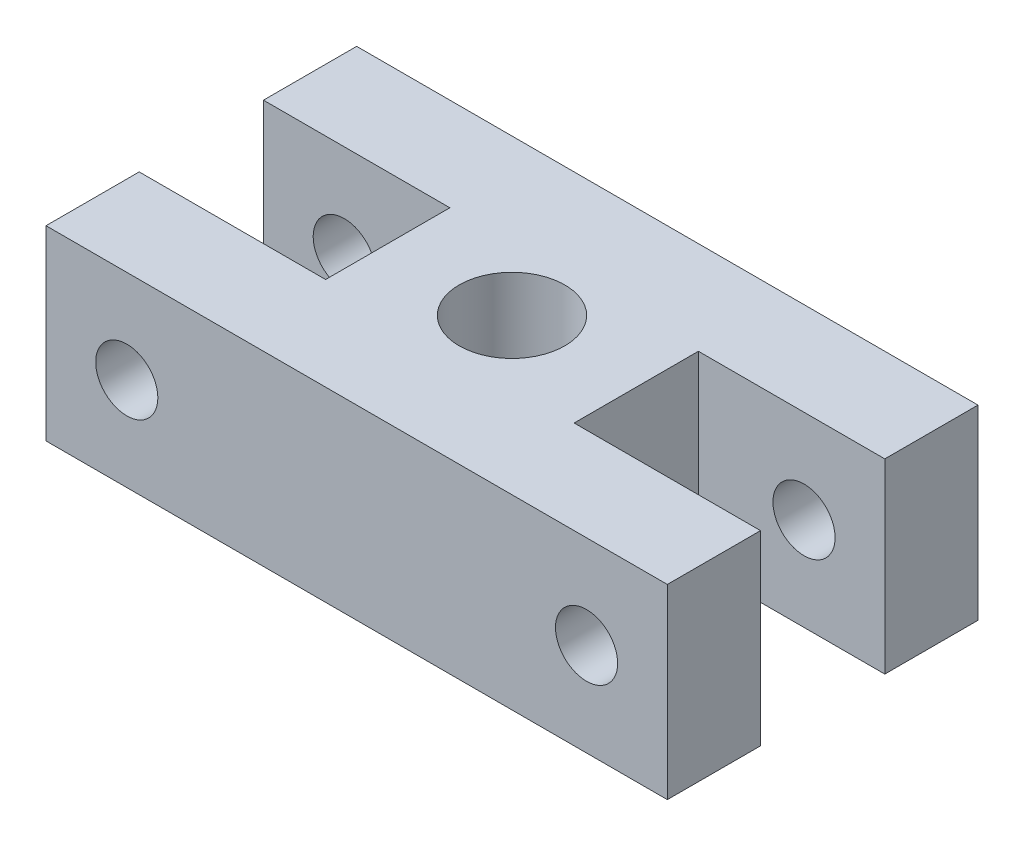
from build123d import *

# Parameters (mm, degrees)
SKIZZE1_W                       = 50
SKIZZE1_H                       = 15
LINEAR_AUSTRAGEN1_DEPTH         = 12.5
SKIZZE2_R                       = 2.5
SCHNITT_LINEAR_AUSTRAGEN1_DEPTH = 37.142080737
SKIZZE3_W                       = 15
SKIZZE3_H                       = 10
SCHNITT_LINEAR_AUSTRAGEN2_DEPTH = 32.721443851
M10_GEWINDEKERNLOCH1_D          = 8.5


with BuildPart() as part:
    # Skizze1 → Linear austragen1 (new, symmetric)
    with BuildSketch(Plane.XY):
        Rectangle(SKIZZE1_W, SKIZZE1_H)
    extrude(amount=LINEAR_AUSTRAGEN1_DEPTH, both=True)

    # Skizze2 → Schnitt-Linear austragen1 (cut, through all)
    with BuildSketch(Plane.XY.offset(12.5)):
        with Locations((-18.5, 0)):
            Circle(SKIZZE2_R)
        with Locations(Location((18.5, 0, 0), (0, 0, 180))):
            Circle(SKIZZE2_R)
    extrude(amount=-SCHNITT_LINEAR_AUSTRAGEN1_DEPTH, mode=Mode.SUBTRACT)

    # Skizze3 → Schnitt-Linear austragen2 (cut, through all)
    with BuildSketch(Plane(origin=(0, 7.5, 0), x_dir=(-1, 0, 0), z_dir=(0, 1, 0))):
        with Locations((17.5, 0)):
            Rectangle(SKIZZE3_W, SKIZZE3_H)
        with Locations((-17.5, 0)):
            Rectangle(SKIZZE3_W, SKIZZE3_H)
    extrude(amount=-SCHNITT_LINEAR_AUSTRAGEN2_DEPTH, mode=Mode.SUBTRACT)

    # M10 Gewindekernloch1 (through all)
    with Locations(Plane(origin=(0, 7.5, 0), x_dir=(-1, 0, 0), z_dir=(0, 1, 0))):
        with Locations((0, 0)):
            Hole(M10_GEWINDEKERNLOCH1_D / 2)


solid = part.part
